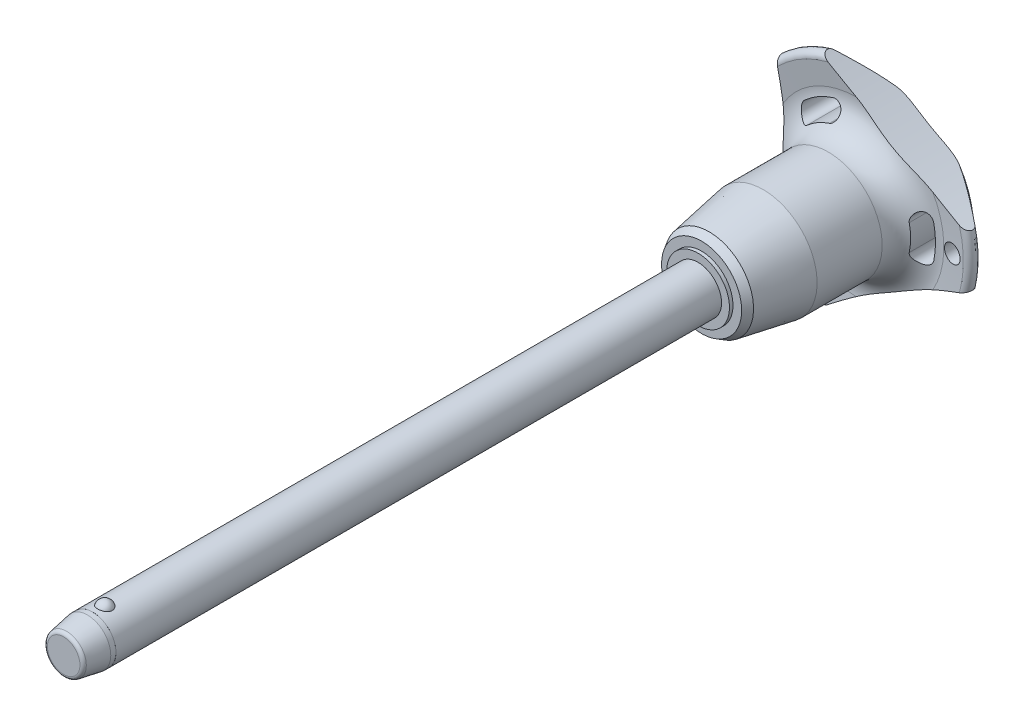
from build123d import *

# Parameters (mm, degrees)
SKETCH1_R           = 4
BOSS_EXTRUDE1_DEPTH = 100
SKETCH2_R           = 3.4
BOSS_EXTRUDE2_DEPTH = 33.3
BOSS_EXTRUDE3_START = 8.2
SKETCH1_2_R         = 4
BOSS_EXTRUDE3_DEPTH = 8.2
CHAMFER1_SIZE       = 4.1
CHAMFER1_SIZE2      = 0.722940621
FILLET1_R           = 0.6
SKETCH6_R           = 102.8
CUT_EXTRUDE1_DEPTH  = 137.15495075
CIRPATTERN1_COUNT   = 3
SKETCH7_R           = 1.5
CUT_EXTRUDE2_DEPTH  = 137.036109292
SKETCH8_R           = 4
SKETCH8_R_2         = 3.99
CUT_EXTRUDE3_DEPTH  = 4.92


with BuildPart() as part:
    # Sketch1 → Boss-Extrude1 (new body)
    with BuildSketch(Plane.XY):
        Circle(SKETCH1_R)
    extrude(amount=-BOSS_EXTRUDE1_DEPTH)

    # Sketch2 → Boss-Extrude2 (add)
    with BuildSketch(Plane(origin=(0, 0, -100), x_dir=(-1, 0, 0), z_dir=(0, 0, -1))):
        Circle(SKETCH2_R)
    extrude(amount=BOSS_EXTRUDE2_DEPTH)

    # Sketch3 → Revolve1 (revolve)
    with BuildSketch(Plane(origin=(0, 0, 0), x_dir=(0, 0, -1), z_dir=(1, 0, 0))):
        with BuildLine():
            Line((-1.2, 4.8), (-1.2, 2.2))
            ThreePointArc((-1.2, 2.2), (0.1, 3.5), (-1.2, 4.8))
        make_face()
        with BuildLine():
            Line((-1.2, -2.2), (-1.2, -4.8))
            ThreePointArc((-1.2, -4.8), (0.1, -3.5), (-1.2, -2.2))
        make_face()
    revolve(axis=Axis((0, -2.2, 1.2), (0, 1, 0)))

    # Sketch1_2 → Boss-Extrude3 (add)
    with BuildSketch(Plane.XY.offset(BOSS_EXTRUDE3_START)):
        Circle(SKETCH1_2_R)
    extrude(amount=-BOSS_EXTRUDE3_DEPTH)

    # Chamfer1
    chamfer1_edges = [part.edges().sort_by_distance(p)[0] for p in [
        (-4, 0, 8.2),
    ]]
    chamfer1_side = [part.faces().sort_by_distance(p)[0] for p in [
        (-4, 0, -45.9),
    ]]
    chamfer(chamfer1_edges, length=CHAMFER1_SIZE, length2=CHAMFER1_SIZE2, reference=chamfer1_side[0])

    # Fillet1
    fillet1_edges = [part.edges().sort_by_distance(p)[0] for p in [
        (-3.277059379, 0, 8.2),
        (3.4, 0, -133.3),
    ]]
    fillet(fillet1_edges, radius=FILLET1_R)

    # Sketch4 → Revolve2 (revolve)
    with BuildSketch(Plane(origin=(0, 0, 0), x_dir=(0, 0, -1), z_dir=(1, 0, 0)), mode=Mode.PRIVATE) as revolve2_sk:
        Polygon((100, 0), (100, 5.353660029), (100.6, 5.353660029), (100.6, 6.834334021), (101.882301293, 7.574671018), (111.1, 9.2), (122.2, 9.2), (122.2, 0), align=None)
    revolve(revolve2_sk.sketch.rotate(Axis((0, 0, -122.2), (0, 0, 1)), 90), axis=Axis((0, 0, -122.2), (0, 0, 1)))

    # Sketch5 → Revolve3 (revolve)
    with BuildSketch(Plane(origin=(0, 0, 0), x_dir=(0, 0, -1), z_dir=(1, 0, 0)), mode=Mode.PRIVATE) as revolve3_sk:
        with BuildLine():
            Line((127.169704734, 14.749576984), (126.756059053, 18.490084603))
            ThreePointArc((126.756059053, 18.490084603), (127.35677658, 19.519442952), (128.516044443, 19.24278761))
            Line((128.516044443, 19.24278761), (132.835691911, 14.094832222))
            ThreePointArc((132.835691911, 14.094832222), (133.3, 12.689260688), (132.67067517, 11.349423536))
            ThreePointArc((132.67067517, 11.349423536), (129.033110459, 6.185112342), (127.75, 0))
            Line((127.75, 0), (122.2, 0))
            Line((122.2, 0), (122.2, 9.2))
            ThreePointArc((122.2, 9.2), (125.924774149, 10.864425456), (127.169704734, 14.749576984))
        make_face()
    revolve(revolve3_sk.sketch.rotate(Axis((0, 0, -127.75), (0, 0, 1)), 90), axis=Axis((0, 0, -127.75), (0, 0, 1)))

    # Sketch6 → Cut-Extrude1 (cut, through all)
    with BuildSketch(Plane.XY):
        with Locations((-115.2, 0)):
            Circle(SKETCH6_R)
        with BuildLine():
            ThreePointArc((13.067738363, -2.789649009), (13.362182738, 0), (13.067738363, 2.789649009))
            ThreePointArc((13.067738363, 2.789649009), (11.421267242, 3.856822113), (10.354094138, 2.210350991))
            ThreePointArc((10.354094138, 2.210350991), (10.587394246, 0), (10.354094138, -2.210350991))
            ThreePointArc((10.354094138, -2.210350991), (11.421267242, -3.856822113), (13.067738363, -2.789649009))
        make_face()
    cut_extrude1 = extrude(amount=-CUT_EXTRUDE1_DEPTH, mode=Mode.SUBTRACT)

    # CirPattern1: Cut-Extrude1 ×3 about axis
    cirpattern1_axis = Axis((0, 0, 0), (0, 0, 1))
    for i in range(1, CIRPATTERN1_COUNT):
        add(cut_extrude1.rotate(cirpattern1_axis, i * 360 / CIRPATTERN1_COUNT), mode=Mode.SUBTRACT)

    # Sketch7 → Cut-Extrude2 (cut, through all)
    with BuildSketch(Plane.XY):
        with Locations(Location((16.362182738, 0, 0), (0, 0, 225.449470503))):
            Circle(SKETCH7_R)
    extrude(amount=-CUT_EXTRUDE2_DEPTH, mode=Mode.SUBTRACT)

    # Sketch8 → Cut-Extrude3 (cut)
    with BuildSketch(Plane.XY.offset(8.2)):
        Circle(SKETCH8_R)
        Circle(SKETCH8_R_2, mode=Mode.SUBTRACT)
    extrude(amount=-CUT_EXTRUDE3_DEPTH, mode=Mode.SUBTRACT)


solid = part.part
